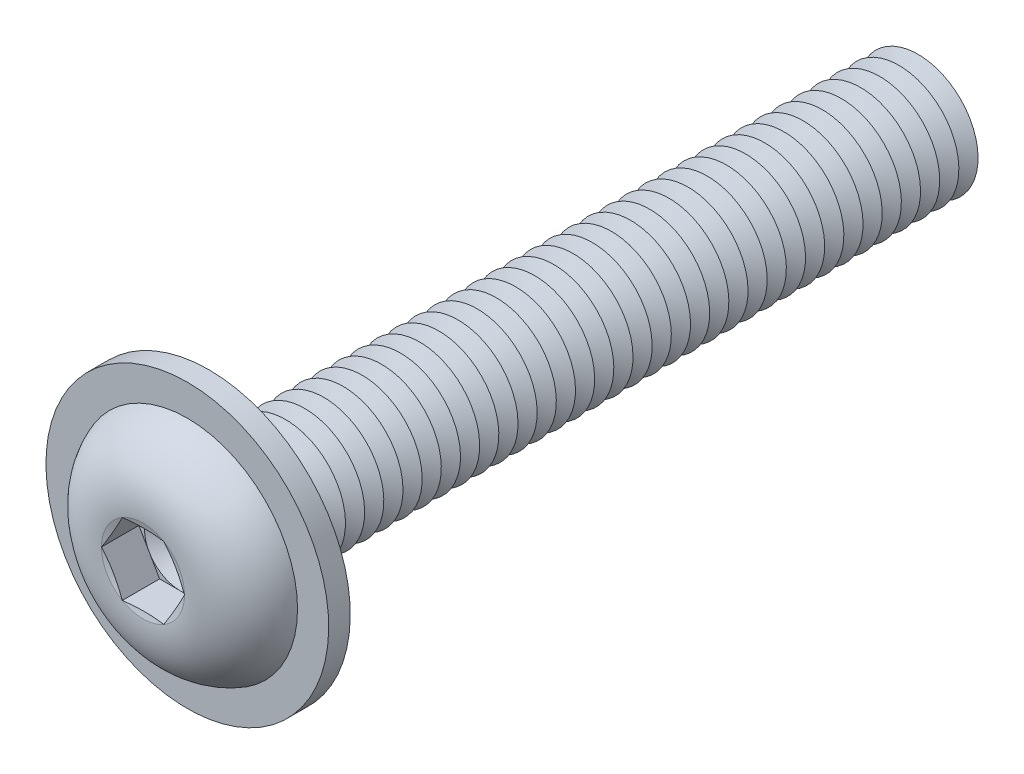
from build123d import *

# Parameters (mm, degrees)
FILLET1_R           = 0.4
LPATTERN1_COUNT     = 37
LPATTERN1_PITCH     = 0.8
CUT_EXTRUDE1_DEPTH  = 1.56
SKETCH5_R           = 5.9
SKETCH5_R_2         = 2.9
BOSS_EXTRUDE1_DEPTH = 0.9


with BuildPart() as part:
    # Sketch1 → Revolve1 (revolve)
    with BuildSketch(Plane(origin=(0, 0, 0), x_dir=(0, 0, -1), z_dir=(1, 0, 0))):
        with BuildLine():
            Line((0, 2.5), (0, 4.75))
            ThreePointArc((0, 4.75), (-2.041477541, 3.848329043), (-2.75, 1.73205))
            Line((-2.75, 1.73205), (-2.517949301, 0.866025))
            Line((-2.517949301, 0.866025), (-2.75, 0.866025))
            Line((-2.75, 0.866025), (-2.75, 0))
            Line((-2.75, 0), (30, 0))
            Line((30, 0), (30, 2.5))
            Line((30, 2.5), (0, 2.5))
        make_face()
    revolve(axis=Axis((0, 0, -30), (0, 0, 1)))

    # Fillet1
    fillet1_edges = [part.edges().sort_by_distance(p)[0] for p in [
        (0, -2.5, 0),
    ]]
    fillet(fillet1_edges, radius=FILLET1_R)

    # Sketch2 → Cut-Revolve1 (revolve, cut)
    with BuildSketch(Plane(origin=(0, 0, 0), x_dir=(0, 0, -1), z_dir=(1, 0, 0))):
        Polygon((29.6, 2.5), (30.4, 2.5), (30, 1.807179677), align=None)
    cut_revolve1 = revolve(axis=Axis((0, 0, -30), (0, 0, -1)), mode=Mode.SUBTRACT)

    # LPattern1: Cut-Revolve1 ×37
    with Locations(*[(0, 0, i * LPATTERN1_PITCH) for i in range(1, LPATTERN1_COUNT)]):
        add(cut_revolve1, mode=Mode.SUBTRACT)

    # Sketch3 → Cut-Extrude1 (cut)
    with BuildSketch(Plane.XY.offset(2.75)):
        Polygon((0.866025, 1.499999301), (-0.866025, 1.499999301), (-1.73205, 0), (-0.866025, -1.499999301), (0.866025, -1.499999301), (1.73205, 0), align=None)
    extrude(amount=-CUT_EXTRUDE1_DEPTH, mode=Mode.SUBTRACT)

    # Cut-Extrude2 cone 1 section (on through the dimple's axis) → Cut-Extrude2 (revolve, cut)
    with BuildSketch(Plane(origin=(0, 0, 1.19), x_dir=(0, -1, 0), z_dir=(1, 0, 0))):
        Polygon((0, 0), (1.499999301, 0), (0, 0.866025), align=None)
    revolve(axis=Axis((0, 0, 1.19), (0, 0, -1)), mode=Mode.SUBTRACT)

    # Sketch5 → Boss-Extrude1 (add)
    with BuildSketch(Plane(origin=(0, 0, 0), x_dir=(-1, 0, 0), z_dir=(0, 0, -1))):
        with Locations(Location((0, 0, 0), (0, 0, 90))):
            Circle(SKETCH5_R)
        Circle(SKETCH5_R_2, mode=Mode.SUBTRACT)
    extrude(amount=-BOSS_EXTRUDE1_DEPTH)


solid = part.part
